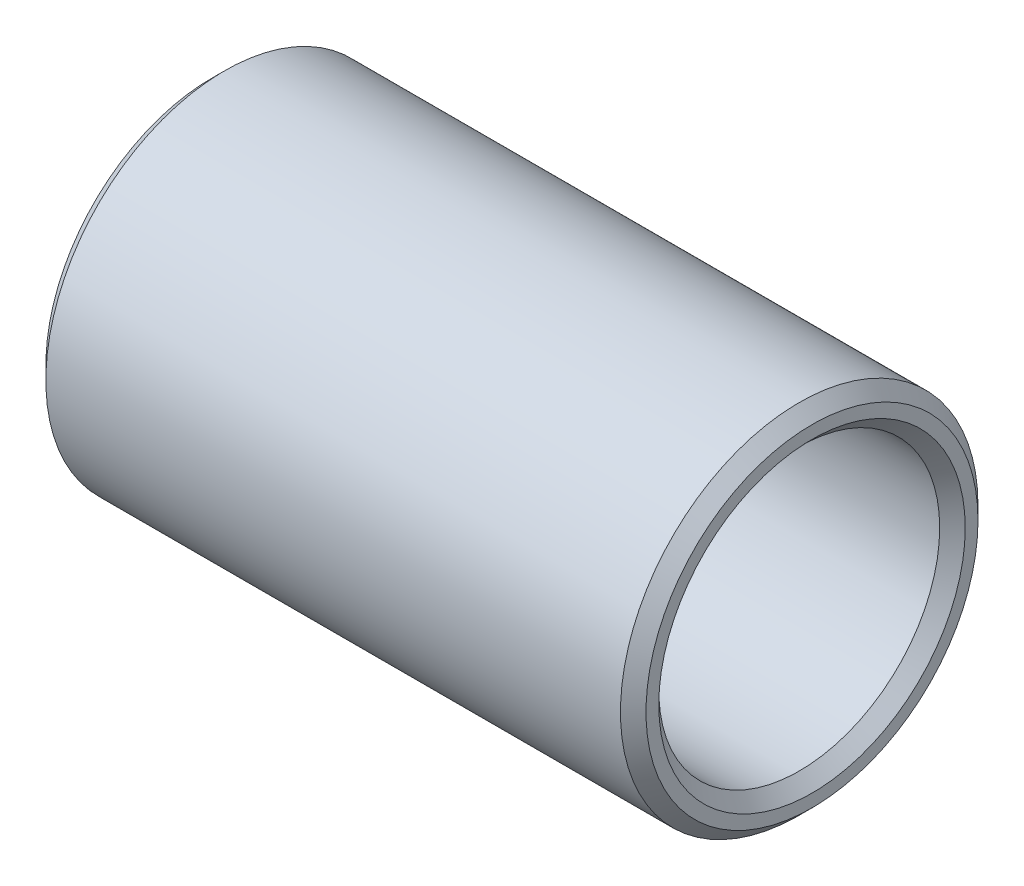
ISO-10303-21;
HEADER;
FILE_DESCRIPTION(('STEP AP214'),'2;1');
FILE_NAME('part.step','',(''),(''),'','','');
FILE_SCHEMA(('AUTOMOTIVE_DESIGN { 1 0 10303 214 1 1 1 1 }'));
ENDSEC;
DATA;
#1=APPLICATION_CONTEXT('core data for automotive mechanical design processes');
#2=APPLICATION_PROTOCOL_DEFINITION('international standard','automotive_design',2000,#1);
#3=PRODUCT_CONTEXT('',#1,'mechanical');
#4=PRODUCT('Part','Part','',(#3));
#5=PRODUCT_RELATED_PRODUCT_CATEGORY('part','',(#4));
#6=PRODUCT_DEFINITION_FORMATION('','',#4);
#7=PRODUCT_DEFINITION_CONTEXT('part definition',#1,'design');
#8=PRODUCT_DEFINITION('design','',#6,#7);
#9=PRODUCT_DEFINITION_SHAPE('','',#8);
#10=(LENGTH_UNIT() NAMED_UNIT(*) SI_UNIT(.MILLI.,.METRE.));
#11=(NAMED_UNIT(*) PLANE_ANGLE_UNIT() SI_UNIT($,.RADIAN.));
#12=(NAMED_UNIT(*) SI_UNIT($,.STERADIAN.) SOLID_ANGLE_UNIT());
#13=UNCERTAINTY_MEASURE_WITH_UNIT(LENGTH_MEASURE(1.E-05),#10,'distance_accuracy_value','');
#14=(GEOMETRIC_REPRESENTATION_CONTEXT(3) GLOBAL_UNCERTAINTY_ASSIGNED_CONTEXT((#13)) GLOBAL_UNIT_ASSIGNED_CONTEXT((#10,
#11,#12)) REPRESENTATION_CONTEXT('',''));
#15=CARTESIAN_POINT('',(0.,0.,0.));
#16=DIRECTION('',(0.,0.,1.));
#17=DIRECTION('',(1.,0.,0.));
#18=AXIS2_PLACEMENT_3D('',#15,#16,#17);
#19=CARTESIAN_POINT('',(0.,13.,0.));
#20=DIRECTION('',(-1.,0.,0.));
#21=DIRECTION('',(0.,0.,1.));
#22=AXIS2_PLACEMENT_3D('',#19,#20,#21);
#23=PLANE('',#22);
#24=CARTESIAN_POINT('',(0.,0.,0.));
#25=DIRECTION('',(1.,0.,0.));
#26=DIRECTION('',(0.,0.,-1.));
#27=AXIS2_PLACEMENT_3D('',#24,#25,#26);
#28=CIRCLE('',#27,12.);
#29=CARTESIAN_POINT('',(0.,0.,-12.));
#30=VERTEX_POINT('',#29);
#31=EDGE_CURVE('E10',#30,#30,#28,.T.);
#32=ORIENTED_EDGE('',*,*,#31,.T.);
#33=EDGE_LOOP('',(#32));
#34=FACE_BOUND('',#33,.T.);
#35=CARTESIAN_POINT('',(0.,0.,0.));
#36=DIRECTION('',(1.,0.,0.));
#37=DIRECTION('',(0.,0.,-1.));
#38=AXIS2_PLACEMENT_3D('',#35,#36,#37);
#39=CIRCLE('',#38,13.);
#40=CARTESIAN_POINT('',(0.,0.,-13.));
#41=VERTEX_POINT('',#40);
#42=EDGE_CURVE('E62',#41,#41,#39,.T.);
#43=ORIENTED_EDGE('',*,*,#42,.F.);
#44=EDGE_LOOP('',(#43));
#45=FACE_BOUND('',#44,.T.);
#46=ADVANCED_FACE('F34',(#34,#45),#23,.T.);
#47=CARTESIAN_POINT('',(0.,0.,0.));
#48=DIRECTION('',(-1.,0.,0.));
#49=DIRECTION('',(0.,0.,1.));
#50=AXIS2_PLACEMENT_3D('',#47,#48,#49);
#51=CONICAL_SURFACE('',#50,12.,0.785398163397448);
#52=CARTESIAN_POINT('',(1.,0.,0.));
#53=DIRECTION('',(1.,0.,0.));
#54=DIRECTION('',(0.,0.,-1.));
#55=AXIS2_PLACEMENT_3D('',#52,#53,#54);
#56=CIRCLE('',#55,11.);
#57=CARTESIAN_POINT('',(1.,0.,-11.));
#58=VERTEX_POINT('',#57);
#59=EDGE_CURVE('E40',#58,#58,#56,.T.);
#60=ORIENTED_EDGE('',*,*,#59,.T.);
#61=EDGE_LOOP('',(#60));
#62=FACE_BOUND('',#61,.T.);
#63=ORIENTED_EDGE('',*,*,#31,.F.);
#64=EDGE_LOOP('',(#63));
#65=FACE_BOUND('',#64,.T.);
#66=ADVANCED_FACE('F70',(#62,#65),#51,.F.);
#67=CARTESIAN_POINT('',(47.,0.,0.));
#68=DIRECTION('',(1.,0.,0.));
#69=DIRECTION('',(0.,0.,-1.));
#70=AXIS2_PLACEMENT_3D('',#67,#68,#69);
#71=CYLINDRICAL_SURFACE('',#70,11.);
#72=CARTESIAN_POINT('',(46.,0.,0.));
#73=DIRECTION('',(1.,0.,0.));
#74=DIRECTION('',(0.,0.,-1.));
#75=AXIS2_PLACEMENT_3D('',#72,#73,#74);
#76=CIRCLE('',#75,11.);
#77=CARTESIAN_POINT('',(46.,0.,-11.));
#78=VERTEX_POINT('',#77);
#79=EDGE_CURVE('E44',#78,#78,#76,.T.);
#80=ORIENTED_EDGE('',*,*,#79,.T.);
#81=EDGE_LOOP('',(#80));
#82=FACE_BOUND('',#81,.T.);
#83=ORIENTED_EDGE('',*,*,#59,.F.);
#84=EDGE_LOOP('',(#83));
#85=FACE_BOUND('',#84,.T.);
#86=ADVANCED_FACE('F74',(#82,#85),#71,.F.);
#87=CARTESIAN_POINT('',(46.,0.,0.));
#88=DIRECTION('',(1.,0.,0.));
#89=DIRECTION('',(0.,0.,-1.));
#90=AXIS2_PLACEMENT_3D('',#87,#88,#89);
#91=CONICAL_SURFACE('',#90,11.,0.785398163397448);
#92=CARTESIAN_POINT('',(47.,0.,0.));
#93=DIRECTION('',(1.,0.,0.));
#94=DIRECTION('',(0.,0.,-1.));
#95=AXIS2_PLACEMENT_3D('',#92,#93,#94);
#96=CIRCLE('',#95,12.);
#97=CARTESIAN_POINT('',(47.,0.,-12.));
#98=VERTEX_POINT('',#97);
#99=EDGE_CURVE('E48',#98,#98,#96,.T.);
#100=ORIENTED_EDGE('',*,*,#99,.T.);
#101=EDGE_LOOP('',(#100));
#102=FACE_BOUND('',#101,.T.);
#103=ORIENTED_EDGE('',*,*,#79,.F.);
#104=EDGE_LOOP('',(#103));
#105=FACE_BOUND('',#104,.T.);
#106=ADVANCED_FACE('F78',(#102,#105),#91,.F.);
#107=CARTESIAN_POINT('',(47.,12.,0.));
#108=DIRECTION('',(1.,0.,0.));
#109=DIRECTION('',(0.,0.,-1.));
#110=AXIS2_PLACEMENT_3D('',#107,#108,#109);
#111=PLANE('',#110);
#112=CARTESIAN_POINT('',(47.,0.,0.));
#113=DIRECTION('',(1.,0.,0.));
#114=DIRECTION('',(0.,0.,-1.));
#115=AXIS2_PLACEMENT_3D('',#112,#113,#114);
#116=CIRCLE('',#115,13.);
#117=CARTESIAN_POINT('',(47.,0.,-13.));
#118=VERTEX_POINT('',#117);
#119=EDGE_CURVE('E53',#118,#118,#116,.T.);
#120=ORIENTED_EDGE('',*,*,#119,.T.);
#121=EDGE_LOOP('',(#120));
#122=FACE_BOUND('',#121,.T.);
#123=ORIENTED_EDGE('',*,*,#99,.F.);
#124=EDGE_LOOP('',(#123));
#125=FACE_BOUND('',#124,.T.);
#126=ADVANCED_FACE('F85',(#122,#125),#111,.T.);
#127=CARTESIAN_POINT('',(47.,0.,0.));
#128=DIRECTION('',(-1.,0.,0.));
#129=DIRECTION('',(0.,0.,1.));
#130=AXIS2_PLACEMENT_3D('',#127,#128,#129);
#131=CONICAL_SURFACE('',#130,13.,0.785398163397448);
#132=CARTESIAN_POINT('',(46.,0.,0.));
#133=DIRECTION('',(1.,0.,0.));
#134=DIRECTION('',(0.,0.,-1.));
#135=AXIS2_PLACEMENT_3D('',#132,#133,#134);
#136=CIRCLE('',#135,14.);
#137=CARTESIAN_POINT('',(46.,0.,-14.));
#138=VERTEX_POINT('',#137);
#139=EDGE_CURVE('E56',#138,#138,#136,.T.);
#140=ORIENTED_EDGE('',*,*,#139,.T.);
#141=EDGE_LOOP('',(#140));
#142=FACE_BOUND('',#141,.T.);
#143=ORIENTED_EDGE('',*,*,#119,.F.);
#144=EDGE_LOOP('',(#143));
#145=FACE_BOUND('',#144,.T.);
#146=ADVANCED_FACE('F89',(#142,#145),#131,.T.);
#147=CARTESIAN_POINT('',(47.,0.,0.));
#148=DIRECTION('',(1.,0.,0.));
#149=DIRECTION('',(0.,0.,-1.));
#150=AXIS2_PLACEMENT_3D('',#147,#148,#149);
#151=CYLINDRICAL_SURFACE('',#150,14.);
#152=CARTESIAN_POINT('',(1.,0.,0.));
#153=DIRECTION('',(1.,0.,0.));
#154=DIRECTION('',(0.,0.,-1.));
#155=AXIS2_PLACEMENT_3D('',#152,#153,#154);
#156=CIRCLE('',#155,14.);
#157=CARTESIAN_POINT('',(1.,0.,-14.));
#158=VERTEX_POINT('',#157);
#159=EDGE_CURVE('E59',#158,#158,#156,.T.);
#160=ORIENTED_EDGE('',*,*,#159,.T.);
#161=EDGE_LOOP('',(#160));
#162=FACE_BOUND('',#161,.T.);
#163=ORIENTED_EDGE('',*,*,#139,.F.);
#164=EDGE_LOOP('',(#163));
#165=FACE_BOUND('',#164,.T.);
#166=ADVANCED_FACE('F93',(#162,#165),#151,.T.);
#167=CARTESIAN_POINT('',(1.,0.,0.));
#168=DIRECTION('',(1.,0.,0.));
#169=DIRECTION('',(0.,0.,-1.));
#170=AXIS2_PLACEMENT_3D('',#167,#168,#169);
#171=CONICAL_SURFACE('',#170,14.,0.785398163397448);
#172=ORIENTED_EDGE('',*,*,#42,.T.);
#173=EDGE_LOOP('',(#172));
#174=FACE_BOUND('',#173,.T.);
#175=ORIENTED_EDGE('',*,*,#159,.F.);
#176=EDGE_LOOP('',(#175));
#177=FACE_BOUND('',#176,.T.);
#178=ADVANCED_FACE('F66',(#174,#177),#171,.T.);
#179=CLOSED_SHELL('',(#46,#66,#86,#106,#126,#146,#166,#178));
#180=MANIFOLD_SOLID_BREP('B2',#179);
#181=ADVANCED_BREP_SHAPE_REPRESENTATION('',(#18,#180),#14);
#182=SHAPE_DEFINITION_REPRESENTATION(#9,#181);
ENDSEC;
END-ISO-10303-21;
